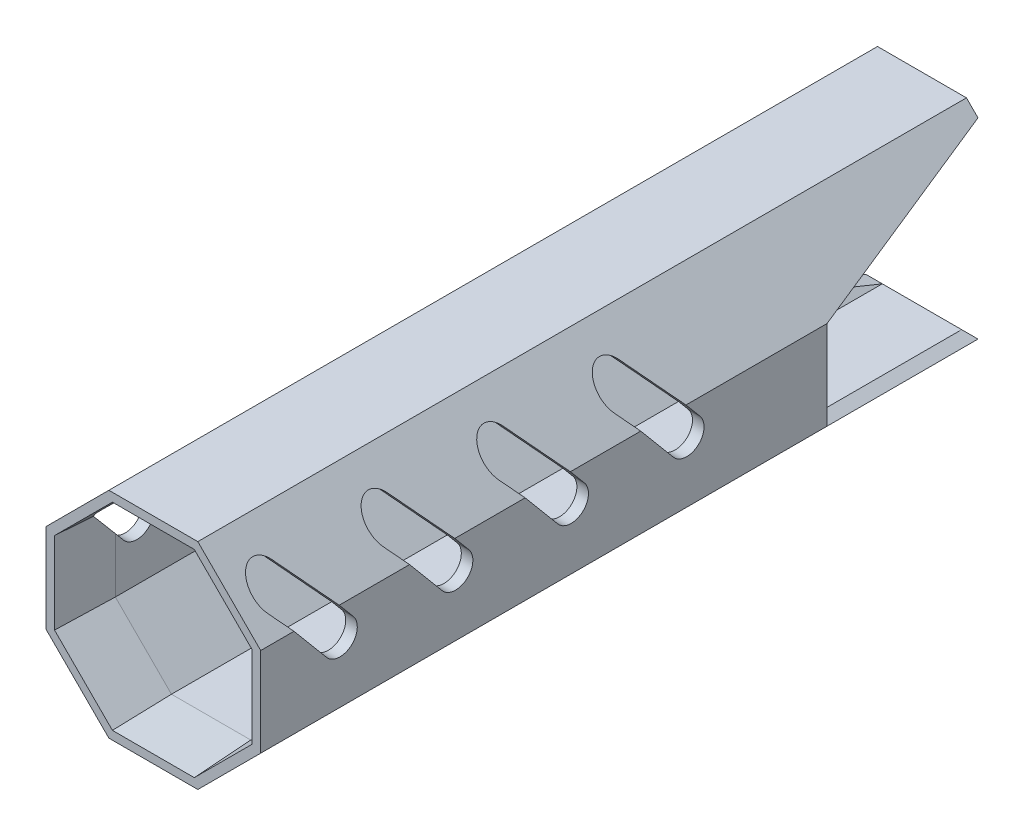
from build123d import *
from OCP.BRepFilletAPI import BRepFilletAPI_MakeChamfer

# Parameters (mm, degrees)
BOSS_EXTRUDE1_DEPTH      = 247
SKETCH2_R                = 17.625
CUT_EXTRUDE1_DEPTH       = 29.65
SKETCH3_R                = 17.625
BOSS_EXTRUDE2_DEPTH      = 29.65
BOSS_EXTRUDE3_DEPTH      = 4.8
FILLET1_R                = 1
BOSS_EXTRUDE4_DEPTH      = 7.694017
BOSS_EXTRUDE4_DEPTH_BACK = 7.69402
BOSS_EXTRUDE6_START      = 15
SKETCH9_R                = 17.625
SKETCH9_R_2              = 13
BOSS_EXTRUDE6_DEPTH      = 15
CHAMFER1_SIZE            = 3
CHAMFER1_SIZE2           = 5.196152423
CUT_EXTRUDE2_DEPTH       = 251.958844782
CUT_EXTRUDE5_DEPTH       = 251.958844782
CUT_EXTRUDE5_DEPTH_BACK  = 251.958844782
SKETCH17_W               = 143.369302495
SKETCH17_H               = 75
CHAMFER2_SIZE            = 10
CHAMFER2_SIZE2           = 0.524077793
LPATTERN1_COUNT          = 9
LPATTERN1_PITCH          = 20
BOSS_EXTRUDE7_DEPTH      = 10
CUT_EXTRUDE3_DEPTH       = 130.823546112
CUT_EXTRUDE3_DEPTH_BACK  = 130.823546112


with BuildPart() as part:
    # Sketch1 → Boss-Extrude1 (new body)
    with BuildSketch(Plane.XY):
        Polygon((18.575, 7.694016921), (7.694016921, 18.575), (-7.694016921, 18.575), (-18.575, 7.694016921), (-18.575, -7.694016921), (-7.694016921, -18.575), (7.694016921, -18.575), (18.575, -7.694016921), align=None)
        Polygon((16.575, 6.865589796), (6.865589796, 16.575), (-6.865589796, 16.575), (-16.575, 6.865589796), (-16.575, -6.865589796), (-6.865589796, -16.575), (6.865589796, -16.575), (16.575, -6.865589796), align=None, mode=Mode.SUBTRACT)
    extrude(amount=BOSS_EXTRUDE1_DEPTH)

    # Sketch2 → Cut-Extrude1 (cut)
    with BuildSketch(Plane.XY.offset(247)):
        Circle(SKETCH2_R)
        Polygon((-16.575, 6.865589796), (-16.575, -6.865589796), (-6.865589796, -16.575), (6.865589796, -16.575), (16.575, -6.865589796), (16.575, 6.865589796), (6.865589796, 16.575), (-6.865589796, 16.575), align=None)
        with BuildLine():
            ThreePointArc((-7.482960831, 15.957628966), (-12.462757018, 12.462757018), (-15.957628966, 7.482960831))
            Line((-15.957628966, 7.482960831), (-7.482960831, 15.957628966))
        make_face()
        with BuildLine():
            ThreePointArc((5.992495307, 16.575), (0, 17.625), (-5.992495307, 16.575))
            Line((-5.992495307, 16.575), (5.992495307, 16.575))
        make_face()
        with BuildLine():
            ThreePointArc((15.957628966, 7.482960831), (12.462757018, 12.462757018), (7.482960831, 15.957628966))
            Line((7.482960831, 15.957628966), (15.957628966, 7.482960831))
        make_face()
        with BuildLine():
            ThreePointArc((17.625, 0), (17.360515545, 3.041894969), (16.575, 5.992495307))
            Line((16.575, 5.992495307), (16.575, -5.992495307))
            ThreePointArc((16.575, -5.992495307), (17.360515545, -3.041894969), (17.625, 0))
        make_face()
        with BuildLine():
            Line((15.957628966, -7.482960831), (7.482960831, -15.957628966))
            ThreePointArc((7.482960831, -15.957628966), (12.462757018, -12.462757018), (15.957628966, -7.482960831))
        make_face()
        with BuildLine():
            Line((5.992495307, -16.575), (-5.992495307, -16.575))
            ThreePointArc((-5.992495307, -16.575), (0, -17.625), (5.992495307, -16.575))
        make_face()
        with BuildLine():
            Line((-7.482960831, -15.957628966), (-15.957628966, -7.482960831))
            ThreePointArc((-15.957628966, -7.482960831), (-12.462757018, -12.462757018), (-7.482960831, -15.957628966))
        make_face()
        with BuildLine():
            Line((-16.575, -5.992495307), (-16.575, 5.992495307))
            ThreePointArc((-16.575, 5.992495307), (-17.625, 0), (-16.575, -5.992495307))
        make_face()
    extrude(amount=-CUT_EXTRUDE1_DEPTH, mode=Mode.SUBTRACT)

    # Sketch3 → Boss-Extrude2 (add)
    with BuildSketch(Plane.XY.offset(247)):
        Polygon((18.575, -7.694016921), (18.575, 7.694016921), (7.694016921, 18.575), (-7.694016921, 18.575), (-18.575, 7.694016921), (-18.575, -7.694016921), (-7.694016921, -18.575), (7.694016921, -18.575), align=None)
        Circle(SKETCH3_R, mode=Mode.SUBTRACT)
    extrude(amount=-BOSS_EXTRUDE2_DEPTH)

    # Sketch4 → Boss-Extrude3 (add)
    with BuildSketch(Plane.XY.offset(247)):
        with BuildLine():
            Line((3.25, 15.216803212), (3.25, 17.322763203))
            ThreePointArc((3.25, 17.322763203), (0, 17.625), (-3.25, 17.322763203))
            Line((-3.25, 17.322763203), (-3.25, 15.216803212))
            ThreePointArc((-3.25, 15.216803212), (0, 15.56), (3.25, 15.216803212))
        make_face()
    boss_extrude3 = extrude(amount=-BOSS_EXTRUDE3_DEPTH)

    # Mirror1: Boss-Extrude3 across plane
    add(boss_extrude3.mirror(Plane.ZX))

    # Fillet1
    fillet1_edges = [part.edges().sort_by_distance(p)[0] for p in [
        (-3.25, 16.269783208, 247),
        (3.25, 16.269783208, 247),
        (-3.25, 16.269783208, 242.2),
        (3.25, 16.269783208, 242.2),
        (3.25, -16.269783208, 242.2),
        (-3.25, -16.269783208, 242.2),
        (-3.25, -16.269783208, 247),
        (3.25, -16.269783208, 247),
    ]]
    fillet(fillet1_edges, radius=FILLET1_R)

    # Sketch5 → Boss-Extrude4 (add, two sides: drawn at the far end of the back side and taken through both)
    with BuildSketch(Plane(origin=(0, 0, 0), x_dir=(0, 0, -1), z_dir=(1, 0, 0)).offset(-BOSS_EXTRUDE4_DEPTH_BACK)):
        Polygon((-237.058028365, 18.575), (-247, 24.315), (-247, 18.575), align=None)
    extrude(amount=BOSS_EXTRUDE4_DEPTH + BOSS_EXTRUDE4_DEPTH_BACK)

    # Sketch9 → Boss-Extrude6 (add)
    with BuildSketch(Plane.XY.offset(217.35).offset(BOSS_EXTRUDE6_START)):
        Circle(SKETCH9_R)
        Circle(SKETCH9_R_2, mode=Mode.SUBTRACT)
    extrude(amount=-BOSS_EXTRUDE6_DEPTH)

    # Chamfer1
    chamfer1_edges = [part.edges().sort_by_distance(p)[0] for p in [
        (11.720294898, -11.720294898, 217.35),
        (16.575, 0, 217.35),
        (11.720294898, 11.720294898, 217.35),
        (0, 16.575, 217.35),
        (-11.720294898, 11.720294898, 217.35),
        (-16.575, 0, 217.35),
        (-11.720294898, -11.720294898, 217.35),
        (0, -16.575, 217.35),
    ]]
    chamfer1_side = [part.faces().sort_by_distance(p)[0] for p in [
        (11.388794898, 11.388794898, 217.35),
    ]]
    chamfer(chamfer1_edges, length=CHAMFER1_SIZE, length2=CHAMFER1_SIZE2, reference=chamfer1_side[0])

    # Sketch13 → Cut-Extrude2 (cut, through all)
    with BuildSketch(Plane(origin=(18.575, 0, 0), x_dir=(0, 0, -1), z_dir=(1, 0, 0))):
        with BuildLine():
            Line((-219.298133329, 10.146637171), (-211.584682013, 0.954103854))
            ThreePointArc((-211.584682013, 0.954103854), (-207.358185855, 0.584333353), (-206.988415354, 4.810829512))
            Line((-206.988415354, 4.810829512), (-214.701866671, 14.003362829))
            ThreePointArc((-214.701866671, 14.003362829), (-218.928362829, 14.373133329), (-219.298133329, 10.146637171))
        make_face()
    cut_extrude2 = extrude(amount=-CUT_EXTRUDE2_DEPTH, mode=Mode.SUBTRACT)

    # Sketch17 → Cut-Extrude5 (cut, two sides: drawn at the far end of the back side and taken through both)
    with BuildSketch(Plane(origin=(18.575, 0, 0), x_dir=(0, 0, -1), z_dir=(1, 0, 0)).offset(-CUT_EXTRUDE5_DEPTH_BACK)):
        with Locations((-194.684651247, 3.075)):
            Rectangle(SKETCH17_W, SKETCH17_H)
    extrude(amount=CUT_EXTRUDE5_DEPTH + CUT_EXTRUDE5_DEPTH_BACK, mode=Mode.SUBTRACT)

    # Chamfer2: one chamfer whose edges measure the first distance from different faces: ONE call of the kernel's chamfer builder (chamfer() names one face for all edges)
    chamfer2_edges_1 = [part.edges().sort_by_distance(p)[0] for p in [
        (11.720294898, -11.720294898, 123),
    ]]
    chamfer2_side_1 = [part.faces().sort_by_distance(p)[0] for p in [
        (11.720294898, -11.720294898, 61.5),
    ]]
    chamfer2_edges_2 = [part.edges().sort_by_distance(p)[0] for p in [
        (16.575, 0, 123),
    ]]
    chamfer2_side_2 = [part.faces().sort_by_distance(p)[0] for p in [
        (16.575, 0, 61.5),
    ]]
    chamfer2_edges_3 = [part.edges().sort_by_distance(p)[0] for p in [
        (11.720294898, 11.720294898, 123),
    ]]
    chamfer2_side_3 = [part.faces().sort_by_distance(p)[0] for p in [
        (11.720294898, 11.720294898, 61.5),
    ]]
    chamfer2_edges_4 = [part.edges().sort_by_distance(p)[0] for p in [
        (0, 16.575, 123),
    ]]
    chamfer2_side_4 = [part.faces().sort_by_distance(p)[0] for p in [
        (0, 16.575, 61.5),
    ]]
    chamfer2_edges_5 = [part.edges().sort_by_distance(p)[0] for p in [
        (-11.720294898, 11.720294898, 123),
    ]]
    chamfer2_side_5 = [part.faces().sort_by_distance(p)[0] for p in [
        (-11.720294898, 11.720294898, 61.5),
    ]]
    chamfer2_edges_6 = [part.edges().sort_by_distance(p)[0] for p in [
        (-16.575, 0, 123),
    ]]
    chamfer2_side_6 = [part.faces().sort_by_distance(p)[0] for p in [
        (-16.575, 0, 61.5),
    ]]
    chamfer2_edges_7 = [part.edges().sort_by_distance(p)[0] for p in [
        (-11.720294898, -11.720294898, 123),
    ]]
    chamfer2_side_7 = [part.faces().sort_by_distance(p)[0] for p in [
        (-11.720294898, -11.720294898, 61.5),
    ]]
    chamfer2_edges_8 = [part.edges().sort_by_distance(p)[0] for p in [
        (0, -16.575, 123),
    ]]
    chamfer2_side_8 = [part.faces().sort_by_distance(p)[0] for p in [
        (0, -16.575, 61.5),
    ]]
    chamfer2 = BRepFilletAPI_MakeChamfer(part.part.solid().wrapped)
    for e in chamfer2_edges_1:
        chamfer2.Add(CHAMFER2_SIZE, CHAMFER2_SIZE2, e.wrapped, chamfer2_side_1[0].wrapped)  # the first distance lies on this face
    for e in chamfer2_edges_2:
        chamfer2.Add(CHAMFER2_SIZE, CHAMFER2_SIZE2, e.wrapped, chamfer2_side_2[0].wrapped)  # the first distance lies on this face
    for e in chamfer2_edges_3:
        chamfer2.Add(CHAMFER2_SIZE, CHAMFER2_SIZE2, e.wrapped, chamfer2_side_3[0].wrapped)  # the first distance lies on this face
    for e in chamfer2_edges_4:
        chamfer2.Add(CHAMFER2_SIZE, CHAMFER2_SIZE2, e.wrapped, chamfer2_side_4[0].wrapped)  # the first distance lies on this face
    for e in chamfer2_edges_5:
        chamfer2.Add(CHAMFER2_SIZE, CHAMFER2_SIZE2, e.wrapped, chamfer2_side_5[0].wrapped)  # the first distance lies on this face
    for e in chamfer2_edges_6:
        chamfer2.Add(CHAMFER2_SIZE, CHAMFER2_SIZE2, e.wrapped, chamfer2_side_6[0].wrapped)  # the first distance lies on this face
    for e in chamfer2_edges_7:
        chamfer2.Add(CHAMFER2_SIZE, CHAMFER2_SIZE2, e.wrapped, chamfer2_side_7[0].wrapped)  # the first distance lies on this face
    for e in chamfer2_edges_8:
        chamfer2.Add(CHAMFER2_SIZE, CHAMFER2_SIZE2, e.wrapped, chamfer2_side_8[0].wrapped)  # the first distance lies on this face
    add(Compound.cast(chamfer2.Shape()), mode=Mode.REPLACE)

    # LPattern1: Cut-Extrude2 ×9
    with Locations(*[(0, 0, -i * LPATTERN1_PITCH) for i in range(1, LPATTERN1_COUNT)]):
        add(cut_extrude2, mode=Mode.SUBTRACT)

    # Sketch18 → Boss-Extrude7 (add)
    with BuildSketch(Plane(origin=(0, 0, 0), x_dir=(-1, 0, 0), z_dir=(0, 0, -1))):
        Polygon((-18.575, -7.694016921), (-7.694016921, -18.575), (7.694016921, -18.575), (18.575, -7.694016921), (18.575, 7.694016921), (7.694016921, 18.575), (-7.694016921, 18.575), (-18.575, 7.694016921), align=None)
        Polygon((-16.575, 6.865589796), (-6.865589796, 16.575), (6.865589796, 16.575), (16.575, 6.865589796), (16.575, -6.865589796), (6.865589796, -16.575), (-6.865589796, -16.575), (-16.575, -6.865589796), align=None, mode=Mode.SUBTRACT)
    extrude(amount=BOSS_EXTRUDE7_DEPTH)

    # Sketch14 → Cut-Extrude3 (cut, two sides: drawn at the far end of the back side and taken through both)
    with BuildSketch(Plane(origin=(18.575, 0, 0), x_dir=(0, 0, -1), z_dir=(1, 0, 0)).offset(-CUT_EXTRUDE3_DEPTH_BACK)):
        Polygon((-25, 7.694016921), (10, 16.575), (10, -16.575), (-25, -7.694016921), align=None)
    extrude(amount=CUT_EXTRUDE3_DEPTH + CUT_EXTRUDE3_DEPTH_BACK, mode=Mode.SUBTRACT)


solid = part.part
